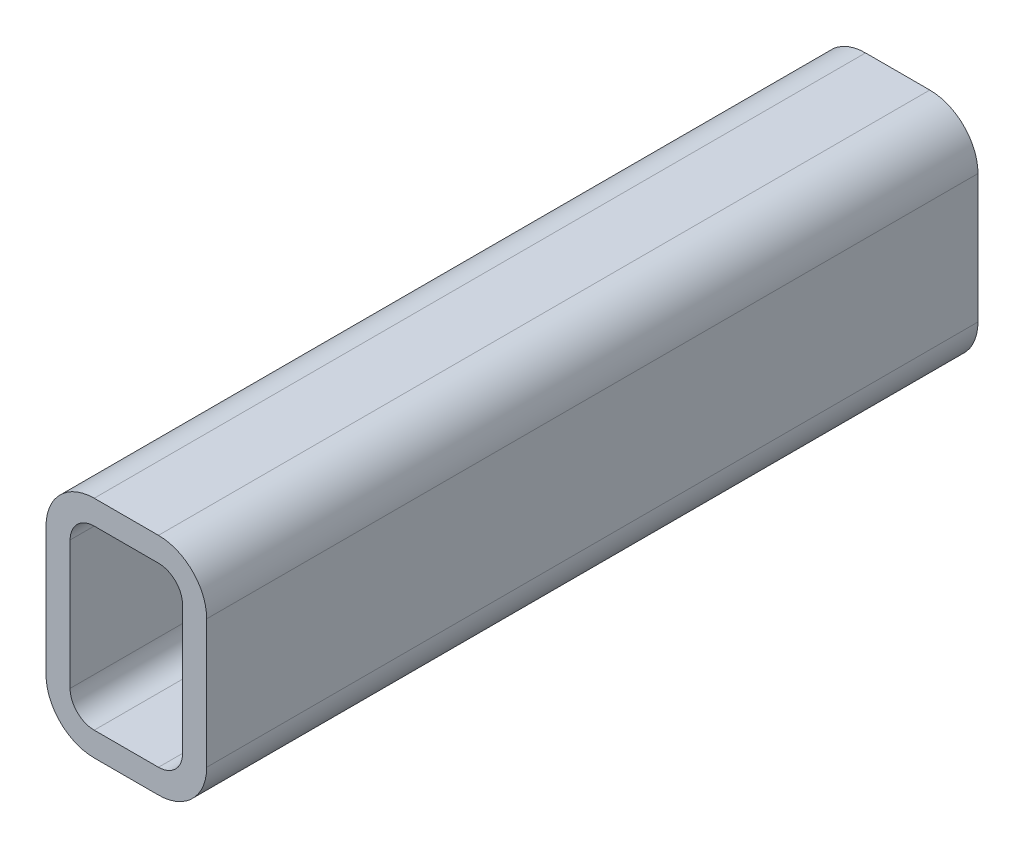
ISO-10303-21;
HEADER;
FILE_DESCRIPTION(('STEP AP214'),'2;1');
FILE_NAME('part.step','',(''),(''),'','','');
FILE_SCHEMA(('AUTOMOTIVE_DESIGN { 1 0 10303 214 1 1 1 1 }'));
ENDSEC;
DATA;
#1=APPLICATION_CONTEXT('core data for automotive mechanical design processes');
#2=APPLICATION_PROTOCOL_DEFINITION('international standard','automotive_design',2000,#1);
#3=PRODUCT_CONTEXT('',#1,'mechanical');
#4=PRODUCT('Part','Part','',(#3));
#5=PRODUCT_RELATED_PRODUCT_CATEGORY('part','',(#4));
#6=PRODUCT_DEFINITION_FORMATION('','',#4);
#7=PRODUCT_DEFINITION_CONTEXT('part definition',#1,'design');
#8=PRODUCT_DEFINITION('design','',#6,#7);
#9=PRODUCT_DEFINITION_SHAPE('','',#8);
#10=(LENGTH_UNIT() NAMED_UNIT(*) SI_UNIT(.MILLI.,.METRE.));
#11=(NAMED_UNIT(*) PLANE_ANGLE_UNIT() SI_UNIT($,.RADIAN.));
#12=(NAMED_UNIT(*) SI_UNIT($,.STERADIAN.) SOLID_ANGLE_UNIT());
#13=UNCERTAINTY_MEASURE_WITH_UNIT(LENGTH_MEASURE(1.E-05),#10,'distance_accuracy_value','');
#14=(GEOMETRIC_REPRESENTATION_CONTEXT(3) GLOBAL_UNCERTAINTY_ASSIGNED_CONTEXT((#13)) GLOBAL_UNIT_ASSIGNED_CONTEXT((#10,
#11,#12)) REPRESENTATION_CONTEXT('',''));
#15=CARTESIAN_POINT('',(0.,0.,0.));
#16=DIRECTION('',(0.,0.,1.));
#17=DIRECTION('',(1.,0.,0.));
#18=AXIS2_PLACEMENT_3D('',#15,#16,#17);
#19=CARTESIAN_POINT('',(21.9460851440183,70.6515103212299,304.8));
#20=DIRECTION('',(0.,0.,1.));
#21=DIRECTION('',(1.,0.,0.));
#22=AXIS2_PLACEMENT_3D('',#19,#20,#21);
#23=PLANE('',#22);
#24=CARTESIAN_POINT('',(21.9460851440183,70.6515103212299,304.8));
#25=DIRECTION('',(0.,0.,1.));
#26=DIRECTION('',(1.,0.,0.));
#27=AXIS2_PLACEMENT_3D('',#24,#25,#26);
#28=CIRCLE('',#27,19.05);
#29=CARTESIAN_POINT('',(21.9460851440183,89.7015103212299,304.8));
#30=VERTEX_POINT('',#29);
#31=CARTESIAN_POINT('',(2.89608514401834,70.6515103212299,304.8));
#32=VERTEX_POINT('',#31);
#33=EDGE_CURVE('E211',#30,#32,#28,.T.);
#34=ORIENTED_EDGE('',*,*,#33,.T.);
#35=DIRECTION('',(0.,-1.,0.));
#36=VECTOR('',#35,1.);
#37=CARTESIAN_POINT('',(2.89608514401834,19.8515103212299,304.8));
#38=LINE('',#37,#36);
#39=CARTESIAN_POINT('',(2.89608514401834,19.8515103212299,304.8));
#40=VERTEX_POINT('',#39);
#41=EDGE_CURVE('E214',#32,#40,#38,.T.);
#42=ORIENTED_EDGE('',*,*,#41,.T.);
#43=CARTESIAN_POINT('',(21.9460851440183,19.8515103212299,304.8));
#44=DIRECTION('',(0.,0.,1.));
#45=DIRECTION('',(1.,0.,0.));
#46=AXIS2_PLACEMENT_3D('',#43,#44,#45);
#47=CIRCLE('',#46,19.05);
#48=CARTESIAN_POINT('',(21.9460851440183,0.801510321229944,304.8));
#49=VERTEX_POINT('',#48);
#50=EDGE_CURVE('E217',#40,#49,#47,.T.);
#51=ORIENTED_EDGE('',*,*,#50,.T.);
#52=DIRECTION('',(1.,0.,0.));
#53=VECTOR('',#52,1.);
#54=CARTESIAN_POINT('',(47.3460851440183,0.801510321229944,304.8));
#55=LINE('',#54,#53);
#56=CARTESIAN_POINT('',(47.3460851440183,0.801510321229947,304.8));
#57=VERTEX_POINT('',#56);
#58=EDGE_CURVE('E219',#49,#57,#55,.T.);
#59=ORIENTED_EDGE('',*,*,#58,.T.);
#60=CARTESIAN_POINT('',(47.3460851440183,19.8515103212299,304.8));
#61=DIRECTION('',(0.,0.,1.));
#62=DIRECTION('',(1.,0.,0.));
#63=AXIS2_PLACEMENT_3D('',#60,#61,#62);
#64=CIRCLE('',#63,19.05);
#65=CARTESIAN_POINT('',(66.3960851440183,19.8515103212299,304.8));
#66=VERTEX_POINT('',#65);
#67=EDGE_CURVE('E221',#57,#66,#64,.T.);
#68=ORIENTED_EDGE('',*,*,#67,.T.);
#69=DIRECTION('',(0.,1.,0.));
#70=VECTOR('',#69,1.);
#71=CARTESIAN_POINT('',(66.3960851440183,70.6515103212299,304.8));
#72=LINE('',#71,#70);
#73=CARTESIAN_POINT('',(66.3960851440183,70.6515103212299,304.8));
#74=VERTEX_POINT('',#73);
#75=EDGE_CURVE('E223',#66,#74,#72,.T.);
#76=ORIENTED_EDGE('',*,*,#75,.T.);
#77=CARTESIAN_POINT('',(47.3460851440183,70.6515103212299,304.8));
#78=DIRECTION('',(0.,0.,1.));
#79=DIRECTION('',(1.,0.,0.));
#80=AXIS2_PLACEMENT_3D('',#77,#78,#79);
#81=CIRCLE('',#80,19.05);
#82=CARTESIAN_POINT('',(47.3460851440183,89.7015103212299,304.8));
#83=VERTEX_POINT('',#82);
#84=EDGE_CURVE('E225',#74,#83,#81,.T.);
#85=ORIENTED_EDGE('',*,*,#84,.T.);
#86=DIRECTION('',(-1.,0.,0.));
#87=VECTOR('',#86,1.);
#88=CARTESIAN_POINT('',(21.9460851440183,89.7015103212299,304.8));
#89=LINE('',#88,#87);
#90=EDGE_CURVE('E227',#83,#30,#89,.T.);
#91=ORIENTED_EDGE('',*,*,#90,.T.);
#92=EDGE_LOOP('',(#34,#42,#51,#59,#68,#76,#85,#91));
#93=FACE_BOUND('',#92,.T.);
#94=DIRECTION('',(0.,-1.,0.));
#95=VECTOR('',#94,1.);
#96=CARTESIAN_POINT('',(12.4210851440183,19.8515103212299,304.8));
#97=LINE('',#96,#95);
#98=CARTESIAN_POINT('',(12.4210851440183,70.6515103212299,304.8));
#99=VERTEX_POINT('',#98);
#100=CARTESIAN_POINT('',(12.4210851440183,19.8515103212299,304.8));
#101=VERTEX_POINT('',#100);
#102=EDGE_CURVE('E154',#99,#101,#97,.T.);
#103=ORIENTED_EDGE('',*,*,#102,.F.);
#104=CARTESIAN_POINT('',(21.9460851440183,70.6515103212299,304.8));
#105=DIRECTION('',(0.,0.,1.));
#106=DIRECTION('',(1.,0.,0.));
#107=AXIS2_PLACEMENT_3D('',#104,#105,#106);
#108=CIRCLE('',#107,9.525);
#109=CARTESIAN_POINT('',(21.9460851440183,80.1765103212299,304.8));
#110=VERTEX_POINT('',#109);
#111=EDGE_CURVE('E146',#110,#99,#108,.T.);
#112=ORIENTED_EDGE('',*,*,#111,.F.);
#113=DIRECTION('',(-1.,0.,0.));
#114=VECTOR('',#113,1.);
#115=CARTESIAN_POINT('',(21.9460851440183,80.1765103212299,304.8));
#116=LINE('',#115,#114);
#117=CARTESIAN_POINT('',(47.3460851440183,80.1765103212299,304.8));
#118=VERTEX_POINT('',#117);
#119=EDGE_CURVE('E179',#118,#110,#116,.T.);
#120=ORIENTED_EDGE('',*,*,#119,.F.);
#121=CARTESIAN_POINT('',(47.3460851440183,70.6515103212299,304.8));
#122=DIRECTION('',(0.,0.,1.));
#123=DIRECTION('',(1.,0.,0.));
#124=AXIS2_PLACEMENT_3D('',#121,#122,#123);
#125=CIRCLE('',#124,9.525);
#126=CARTESIAN_POINT('',(56.8710851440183,70.6515103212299,304.8));
#127=VERTEX_POINT('',#126);
#128=EDGE_CURVE('E177',#127,#118,#125,.T.);
#129=ORIENTED_EDGE('',*,*,#128,.F.);
#130=DIRECTION('',(0.,1.,0.));
#131=VECTOR('',#130,1.);
#132=CARTESIAN_POINT('',(56.8710851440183,70.6515103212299,304.8));
#133=LINE('',#132,#131);
#134=CARTESIAN_POINT('',(56.8710851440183,19.8515103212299,304.8));
#135=VERTEX_POINT('',#134);
#136=EDGE_CURVE('E175',#135,#127,#133,.T.);
#137=ORIENTED_EDGE('',*,*,#136,.F.);
#138=CARTESIAN_POINT('',(47.3460851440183,19.8515103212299,304.8));
#139=DIRECTION('',(0.,0.,1.));
#140=DIRECTION('',(1.,0.,0.));
#141=AXIS2_PLACEMENT_3D('',#138,#139,#140);
#142=CIRCLE('',#141,9.525);
#143=CARTESIAN_POINT('',(47.3460851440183,10.3265103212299,304.8));
#144=VERTEX_POINT('',#143);
#145=EDGE_CURVE('E173',#144,#135,#142,.T.);
#146=ORIENTED_EDGE('',*,*,#145,.F.);
#147=DIRECTION('',(1.,0.,0.));
#148=VECTOR('',#147,1.);
#149=CARTESIAN_POINT('',(47.3460851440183,10.3265103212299,304.8));
#150=LINE('',#149,#148);
#151=CARTESIAN_POINT('',(21.9460851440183,10.3265103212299,304.8));
#152=VERTEX_POINT('',#151);
#153=EDGE_CURVE('E169',#152,#144,#150,.T.);
#154=ORIENTED_EDGE('',*,*,#153,.F.);
#155=CARTESIAN_POINT('',(21.9460851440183,19.8515103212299,304.8));
#156=DIRECTION('',(0.,0.,1.));
#157=DIRECTION('',(1.,0.,0.));
#158=AXIS2_PLACEMENT_3D('',#155,#156,#157);
#159=CIRCLE('',#158,9.525);
#160=EDGE_CURVE('E167',#101,#152,#159,.T.);
#161=ORIENTED_EDGE('',*,*,#160,.F.);
#162=EDGE_LOOP('',(#103,#112,#120,#129,#137,#146,#154,#161));
#163=FACE_BOUND('',#162,.T.);
#164=ADVANCED_FACE('F33',(#93,#163),#23,.T.);
#165=CARTESIAN_POINT('',(21.9460851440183,70.6515103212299,0.));
#166=DIRECTION('',(0.,0.,1.));
#167=DIRECTION('',(1.,0.,0.));
#168=AXIS2_PLACEMENT_3D('',#165,#166,#167);
#169=PLANE('',#168);
#170=CARTESIAN_POINT('',(21.9460851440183,70.6515103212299,0.));
#171=DIRECTION('',(0.,0.,1.));
#172=DIRECTION('',(1.,0.,0.));
#173=AXIS2_PLACEMENT_3D('',#170,#171,#172);
#174=CIRCLE('',#173,19.05);
#175=CARTESIAN_POINT('',(21.9460851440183,89.7015103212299,0.));
#176=VERTEX_POINT('',#175);
#177=CARTESIAN_POINT('',(2.89608514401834,70.6515103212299,0.));
#178=VERTEX_POINT('',#177);
#179=EDGE_CURVE('E162',#176,#178,#174,.T.);
#180=ORIENTED_EDGE('',*,*,#179,.F.);
#181=DIRECTION('',(-1.,0.,0.));
#182=VECTOR('',#181,1.);
#183=CARTESIAN_POINT('',(21.9460851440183,89.7015103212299,0.));
#184=LINE('',#183,#182);
#185=CARTESIAN_POINT('',(47.3460851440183,89.7015103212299,0.));
#186=VERTEX_POINT('',#185);
#187=EDGE_CURVE('E215',#186,#176,#184,.T.);
#188=ORIENTED_EDGE('',*,*,#187,.F.);
#189=CARTESIAN_POINT('',(47.3460851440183,70.6515103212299,0.));
#190=DIRECTION('',(0.,0.,1.));
#191=DIRECTION('',(1.,0.,0.));
#192=AXIS2_PLACEMENT_3D('',#189,#190,#191);
#193=CIRCLE('',#192,19.05);
#194=CARTESIAN_POINT('',(66.3960851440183,70.6515103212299,0.));
#195=VERTEX_POINT('',#194);
#196=EDGE_CURVE('E242',#195,#186,#193,.T.);
#197=ORIENTED_EDGE('',*,*,#196,.F.);
#198=DIRECTION('',(0.,1.,0.));
#199=VECTOR('',#198,1.);
#200=CARTESIAN_POINT('',(66.3960851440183,70.6515103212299,0.));
#201=LINE('',#200,#199);
#202=CARTESIAN_POINT('',(66.3960851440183,19.8515103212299,0.));
#203=VERTEX_POINT('',#202);
#204=EDGE_CURVE('E240',#203,#195,#201,.T.);
#205=ORIENTED_EDGE('',*,*,#204,.F.);
#206=CARTESIAN_POINT('',(47.3460851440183,19.8515103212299,0.));
#207=DIRECTION('',(0.,0.,1.));
#208=DIRECTION('',(1.,0.,0.));
#209=AXIS2_PLACEMENT_3D('',#206,#207,#208);
#210=CIRCLE('',#209,19.05);
#211=CARTESIAN_POINT('',(47.3460851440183,0.801510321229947,0.));
#212=VERTEX_POINT('',#211);
#213=EDGE_CURVE('E238',#212,#203,#210,.T.);
#214=ORIENTED_EDGE('',*,*,#213,.F.);
#215=DIRECTION('',(1.,0.,0.));
#216=VECTOR('',#215,1.);
#217=CARTESIAN_POINT('',(47.3460851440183,0.801510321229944,0.));
#218=LINE('',#217,#216);
#219=CARTESIAN_POINT('',(21.9460851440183,0.801510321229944,0.));
#220=VERTEX_POINT('',#219);
#221=EDGE_CURVE('E236',#220,#212,#218,.T.);
#222=ORIENTED_EDGE('',*,*,#221,.F.);
#223=CARTESIAN_POINT('',(21.9460851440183,19.8515103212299,0.));
#224=DIRECTION('',(0.,0.,1.));
#225=DIRECTION('',(1.,0.,0.));
#226=AXIS2_PLACEMENT_3D('',#223,#224,#225);
#227=CIRCLE('',#226,19.05);
#228=CARTESIAN_POINT('',(2.89608514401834,19.8515103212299,0.));
#229=VERTEX_POINT('',#228);
#230=EDGE_CURVE('E234',#229,#220,#227,.T.);
#231=ORIENTED_EDGE('',*,*,#230,.F.);
#232=DIRECTION('',(0.,-1.,0.));
#233=VECTOR('',#232,1.);
#234=CARTESIAN_POINT('',(2.89608514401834,19.8515103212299,0.));
#235=LINE('',#234,#233);
#236=EDGE_CURVE('E232',#178,#229,#235,.T.);
#237=ORIENTED_EDGE('',*,*,#236,.F.);
#238=EDGE_LOOP('',(#180,#188,#197,#205,#214,#222,#231,#237));
#239=FACE_BOUND('',#238,.T.);
#240=CARTESIAN_POINT('',(21.9460851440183,70.6515103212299,0.));
#241=DIRECTION('',(0.,0.,1.));
#242=DIRECTION('',(1.,0.,0.));
#243=AXIS2_PLACEMENT_3D('',#240,#241,#242);
#244=CIRCLE('',#243,9.525);
#245=CARTESIAN_POINT('',(21.9460851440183,80.1765103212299,0.));
#246=VERTEX_POINT('',#245);
#247=CARTESIAN_POINT('',(12.4210851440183,70.6515103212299,0.));
#248=VERTEX_POINT('',#247);
#249=EDGE_CURVE('E56',#246,#248,#244,.T.);
#250=ORIENTED_EDGE('',*,*,#249,.T.);
#251=DIRECTION('',(0.,-1.,0.));
#252=VECTOR('',#251,1.);
#253=CARTESIAN_POINT('',(12.4210851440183,19.8515103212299,0.));
#254=LINE('',#253,#252);
#255=CARTESIAN_POINT('',(12.4210851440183,19.8515103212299,0.));
#256=VERTEX_POINT('',#255);
#257=EDGE_CURVE('E161',#248,#256,#254,.T.);
#258=ORIENTED_EDGE('',*,*,#257,.T.);
#259=CARTESIAN_POINT('',(21.9460851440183,19.8515103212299,0.));
#260=DIRECTION('',(0.,0.,1.));
#261=DIRECTION('',(1.,0.,0.));
#262=AXIS2_PLACEMENT_3D('',#259,#260,#261);
#263=CIRCLE('',#262,9.525);
#264=CARTESIAN_POINT('',(21.9460851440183,10.3265103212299,0.));
#265=VERTEX_POINT('',#264);
#266=EDGE_CURVE('E183',#256,#265,#263,.T.);
#267=ORIENTED_EDGE('',*,*,#266,.T.);
#268=DIRECTION('',(1.,0.,0.));
#269=VECTOR('',#268,1.);
#270=CARTESIAN_POINT('',(47.3460851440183,10.3265103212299,0.));
#271=LINE('',#270,#269);
#272=CARTESIAN_POINT('',(47.3460851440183,10.3265103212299,0.));
#273=VERTEX_POINT('',#272);
#274=EDGE_CURVE('E186',#265,#273,#271,.T.);
#275=ORIENTED_EDGE('',*,*,#274,.T.);
#276=CARTESIAN_POINT('',(47.3460851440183,19.8515103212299,0.));
#277=DIRECTION('',(0.,0.,1.));
#278=DIRECTION('',(1.,0.,0.));
#279=AXIS2_PLACEMENT_3D('',#276,#277,#278);
#280=CIRCLE('',#279,9.525);
#281=CARTESIAN_POINT('',(56.8710851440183,19.8515103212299,0.));
#282=VERTEX_POINT('',#281);
#283=EDGE_CURVE('E189',#273,#282,#280,.T.);
#284=ORIENTED_EDGE('',*,*,#283,.T.);
#285=DIRECTION('',(0.,1.,0.));
#286=VECTOR('',#285,1.);
#287=CARTESIAN_POINT('',(56.8710851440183,70.6515103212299,0.));
#288=LINE('',#287,#286);
#289=CARTESIAN_POINT('',(56.8710851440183,70.6515103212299,0.));
#290=VERTEX_POINT('',#289);
#291=EDGE_CURVE('E192',#282,#290,#288,.T.);
#292=ORIENTED_EDGE('',*,*,#291,.T.);
#293=CARTESIAN_POINT('',(47.3460851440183,70.6515103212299,0.));
#294=DIRECTION('',(0.,0.,1.));
#295=DIRECTION('',(1.,0.,0.));
#296=AXIS2_PLACEMENT_3D('',#293,#294,#295);
#297=CIRCLE('',#296,9.525);
#298=CARTESIAN_POINT('',(47.3460851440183,80.1765103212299,0.));
#299=VERTEX_POINT('',#298);
#300=EDGE_CURVE('E195',#290,#299,#297,.T.);
#301=ORIENTED_EDGE('',*,*,#300,.T.);
#302=DIRECTION('',(-1.,0.,0.));
#303=VECTOR('',#302,1.);
#304=CARTESIAN_POINT('',(21.9460851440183,80.1765103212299,0.));
#305=LINE('',#304,#303);
#306=EDGE_CURVE('E155',#299,#246,#305,.T.);
#307=ORIENTED_EDGE('',*,*,#306,.T.);
#308=EDGE_LOOP('',(#250,#258,#267,#275,#284,#292,#301,#307));
#309=FACE_BOUND('',#308,.T.);
#310=ADVANCED_FACE('F272',(#239,#309),#169,.F.);
#311=CARTESIAN_POINT('',(21.9460851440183,70.6515103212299,304.8));
#312=DIRECTION('',(0.,0.,-1.));
#313=DIRECTION('',(-1.,0.,0.));
#314=AXIS2_PLACEMENT_3D('',#311,#312,#313);
#315=CYLINDRICAL_SURFACE('',#314,19.05);
#316=ORIENTED_EDGE('',*,*,#179,.T.);
#317=DIRECTION('',(0.,0.,-1.));
#318=VECTOR('',#317,1.);
#319=CARTESIAN_POINT('',(2.89608514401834,70.6515103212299,304.8));
#320=LINE('',#319,#318);
#321=EDGE_CURVE('E11',#32,#178,#320,.T.);
#322=ORIENTED_EDGE('',*,*,#321,.F.);
#323=ORIENTED_EDGE('',*,*,#33,.F.);
#324=DIRECTION('',(0.,0.,-1.));
#325=VECTOR('',#324,1.);
#326=CARTESIAN_POINT('',(21.9460851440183,89.7015103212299,304.8));
#327=LINE('',#326,#325);
#328=EDGE_CURVE('E229',#30,#176,#327,.T.);
#329=ORIENTED_EDGE('',*,*,#328,.T.);
#330=EDGE_LOOP('',(#316,#322,#323,#329));
#331=FACE_BOUND('',#330,.T.);
#332=ADVANCED_FACE('F35',(#331),#315,.T.);
#333=CARTESIAN_POINT('',(2.89608514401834,19.8515103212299,304.8));
#334=DIRECTION('',(1.,0.,0.));
#335=DIRECTION('',(0.,0.,-1.));
#336=AXIS2_PLACEMENT_3D('',#333,#334,#335);
#337=PLANE('',#336);
#338=ORIENTED_EDGE('',*,*,#236,.T.);
#339=DIRECTION('',(0.,0.,-1.));
#340=VECTOR('',#339,1.);
#341=CARTESIAN_POINT('',(2.89608514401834,19.8515103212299,304.8));
#342=LINE('',#341,#340);
#343=EDGE_CURVE('E41',#40,#229,#342,.T.);
#344=ORIENTED_EDGE('',*,*,#343,.F.);
#345=ORIENTED_EDGE('',*,*,#41,.F.);
#346=ORIENTED_EDGE('',*,*,#321,.T.);
#347=EDGE_LOOP('',(#338,#344,#345,#346));
#348=FACE_BOUND('',#347,.T.);
#349=ADVANCED_FACE('F289',(#348),#337,.F.);
#350=CARTESIAN_POINT('',(21.9460851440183,19.8515103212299,304.8));
#351=DIRECTION('',(0.,0.,-1.));
#352=DIRECTION('',(-1.,0.,0.));
#353=AXIS2_PLACEMENT_3D('',#350,#351,#352);
#354=CYLINDRICAL_SURFACE('',#353,19.05);
#355=ORIENTED_EDGE('',*,*,#230,.T.);
#356=DIRECTION('',(0.,0.,-1.));
#357=VECTOR('',#356,1.);
#358=CARTESIAN_POINT('',(21.9460851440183,0.801510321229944,304.8));
#359=LINE('',#358,#357);
#360=EDGE_CURVE('E259',#49,#220,#359,.T.);
#361=ORIENTED_EDGE('',*,*,#360,.F.);
#362=ORIENTED_EDGE('',*,*,#50,.F.);
#363=ORIENTED_EDGE('',*,*,#343,.T.);
#364=EDGE_LOOP('',(#355,#361,#362,#363));
#365=FACE_BOUND('',#364,.T.);
#366=ADVANCED_FACE('F266',(#365),#354,.T.);
#367=CARTESIAN_POINT('',(47.3460851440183,0.801510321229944,304.8));
#368=DIRECTION('',(0.,1.,0.));
#369=DIRECTION('',(0.,0.,1.));
#370=AXIS2_PLACEMENT_3D('',#367,#368,#369);
#371=PLANE('',#370);
#372=ORIENTED_EDGE('',*,*,#221,.T.);
#373=DIRECTION('',(0.,0.,-1.));
#374=VECTOR('',#373,1.);
#375=CARTESIAN_POINT('',(47.3460851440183,0.801510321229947,304.8));
#376=LINE('',#375,#374);
#377=EDGE_CURVE('E256',#57,#212,#376,.T.);
#378=ORIENTED_EDGE('',*,*,#377,.F.);
#379=ORIENTED_EDGE('',*,*,#58,.F.);
#380=ORIENTED_EDGE('',*,*,#360,.T.);
#381=EDGE_LOOP('',(#372,#378,#379,#380));
#382=FACE_BOUND('',#381,.T.);
#383=ADVANCED_FACE('F278',(#382),#371,.F.);
#384=CARTESIAN_POINT('',(47.3460851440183,19.8515103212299,304.8));
#385=DIRECTION('',(0.,0.,-1.));
#386=DIRECTION('',(-1.,0.,0.));
#387=AXIS2_PLACEMENT_3D('',#384,#385,#386);
#388=CYLINDRICAL_SURFACE('',#387,19.05);
#389=ORIENTED_EDGE('',*,*,#213,.T.);
#390=DIRECTION('',(0.,0.,-1.));
#391=VECTOR('',#390,1.);
#392=CARTESIAN_POINT('',(66.3960851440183,19.8515103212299,304.8));
#393=LINE('',#392,#391);
#394=EDGE_CURVE('E253',#66,#203,#393,.T.);
#395=ORIENTED_EDGE('',*,*,#394,.F.);
#396=ORIENTED_EDGE('',*,*,#67,.F.);
#397=ORIENTED_EDGE('',*,*,#377,.T.);
#398=EDGE_LOOP('',(#389,#395,#396,#397));
#399=FACE_BOUND('',#398,.T.);
#400=ADVANCED_FACE('F282',(#399),#388,.T.);
#401=CARTESIAN_POINT('',(66.3960851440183,70.6515103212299,304.8));
#402=DIRECTION('',(-1.,0.,0.));
#403=DIRECTION('',(0.,0.,1.));
#404=AXIS2_PLACEMENT_3D('',#401,#402,#403);
#405=PLANE('',#404);
#406=ORIENTED_EDGE('',*,*,#204,.T.);
#407=DIRECTION('',(0.,0.,-1.));
#408=VECTOR('',#407,1.);
#409=CARTESIAN_POINT('',(66.3960851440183,70.6515103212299,304.8));
#410=LINE('',#409,#408);
#411=EDGE_CURVE('E250',#74,#195,#410,.T.);
#412=ORIENTED_EDGE('',*,*,#411,.F.);
#413=ORIENTED_EDGE('',*,*,#75,.F.);
#414=ORIENTED_EDGE('',*,*,#394,.T.);
#415=EDGE_LOOP('',(#406,#412,#413,#414));
#416=FACE_BOUND('',#415,.T.);
#417=ADVANCED_FACE('F302',(#416),#405,.F.);
#418=CARTESIAN_POINT('',(47.3460851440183,70.6515103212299,304.8));
#419=DIRECTION('',(0.,0.,-1.));
#420=DIRECTION('',(-1.,0.,0.));
#421=AXIS2_PLACEMENT_3D('',#418,#419,#420);
#422=CYLINDRICAL_SURFACE('',#421,19.05);
#423=ORIENTED_EDGE('',*,*,#196,.T.);
#424=DIRECTION('',(0.,0.,-1.));
#425=VECTOR('',#424,1.);
#426=CARTESIAN_POINT('',(47.3460851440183,89.7015103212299,304.8));
#427=LINE('',#426,#425);
#428=EDGE_CURVE('E247',#83,#186,#427,.T.);
#429=ORIENTED_EDGE('',*,*,#428,.F.);
#430=ORIENTED_EDGE('',*,*,#84,.F.);
#431=ORIENTED_EDGE('',*,*,#411,.T.);
#432=EDGE_LOOP('',(#423,#429,#430,#431));
#433=FACE_BOUND('',#432,.T.);
#434=ADVANCED_FACE('F300',(#433),#422,.T.);
#435=CARTESIAN_POINT('',(21.9460851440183,89.7015103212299,304.8));
#436=DIRECTION('',(0.,-1.,0.));
#437=DIRECTION('',(0.,0.,-1.));
#438=AXIS2_PLACEMENT_3D('',#435,#436,#437);
#439=PLANE('',#438);
#440=ORIENTED_EDGE('',*,*,#187,.T.);
#441=ORIENTED_EDGE('',*,*,#328,.F.);
#442=ORIENTED_EDGE('',*,*,#90,.F.);
#443=ORIENTED_EDGE('',*,*,#428,.T.);
#444=EDGE_LOOP('',(#440,#441,#442,#443));
#445=FACE_BOUND('',#444,.T.);
#446=ADVANCED_FACE('F295',(#445),#439,.F.);
#447=CARTESIAN_POINT('',(21.9460851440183,70.6515103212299,304.8));
#448=DIRECTION('',(0.,0.,-1.));
#449=DIRECTION('',(-1.,0.,0.));
#450=AXIS2_PLACEMENT_3D('',#447,#448,#449);
#451=CYLINDRICAL_SURFACE('',#450,9.525);
#452=ORIENTED_EDGE('',*,*,#249,.F.);
#453=DIRECTION('',(0.,0.,-1.));
#454=VECTOR('',#453,1.);
#455=CARTESIAN_POINT('',(21.9460851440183,80.1765103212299,304.8));
#456=LINE('',#455,#454);
#457=EDGE_CURVE('E150',#110,#246,#456,.T.);
#458=ORIENTED_EDGE('',*,*,#457,.F.);
#459=ORIENTED_EDGE('',*,*,#111,.T.);
#460=DIRECTION('',(0.,0.,-1.));
#461=VECTOR('',#460,1.);
#462=CARTESIAN_POINT('',(12.4210851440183,70.6515103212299,304.8));
#463=LINE('',#462,#461);
#464=EDGE_CURVE('E149',#99,#248,#463,.T.);
#465=ORIENTED_EDGE('',*,*,#464,.T.);
#466=EDGE_LOOP('',(#452,#458,#459,#465));
#467=FACE_BOUND('',#466,.T.);
#468=ADVANCED_FACE('F148',(#467),#451,.F.);
#469=CARTESIAN_POINT('',(12.4210851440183,19.8515103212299,304.8));
#470=DIRECTION('',(1.,0.,0.));
#471=DIRECTION('',(0.,0.,-1.));
#472=AXIS2_PLACEMENT_3D('',#469,#470,#471);
#473=PLANE('',#472);
#474=ORIENTED_EDGE('',*,*,#257,.F.);
#475=ORIENTED_EDGE('',*,*,#464,.F.);
#476=ORIENTED_EDGE('',*,*,#102,.T.);
#477=DIRECTION('',(0.,0.,-1.));
#478=VECTOR('',#477,1.);
#479=CARTESIAN_POINT('',(12.4210851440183,19.8515103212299,304.8));
#480=LINE('',#479,#478);
#481=EDGE_CURVE('E163',#101,#256,#480,.T.);
#482=ORIENTED_EDGE('',*,*,#481,.T.);
#483=EDGE_LOOP('',(#474,#475,#476,#482));
#484=FACE_BOUND('',#483,.T.);
#485=ADVANCED_FACE('F158',(#484),#473,.T.);
#486=CARTESIAN_POINT('',(21.9460851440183,19.8515103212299,304.8));
#487=DIRECTION('',(0.,0.,-1.));
#488=DIRECTION('',(-1.,0.,0.));
#489=AXIS2_PLACEMENT_3D('',#486,#487,#488);
#490=CYLINDRICAL_SURFACE('',#489,9.525);
#491=ORIENTED_EDGE('',*,*,#266,.F.);
#492=ORIENTED_EDGE('',*,*,#481,.F.);
#493=ORIENTED_EDGE('',*,*,#160,.T.);
#494=DIRECTION('',(0.,0.,-1.));
#495=VECTOR('',#494,1.);
#496=CARTESIAN_POINT('',(21.9460851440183,10.3265103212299,304.8));
#497=LINE('',#496,#495);
#498=EDGE_CURVE('E208',#152,#265,#497,.T.);
#499=ORIENTED_EDGE('',*,*,#498,.T.);
#500=EDGE_LOOP('',(#491,#492,#493,#499));
#501=FACE_BOUND('',#500,.T.);
#502=ADVANCED_FACE('F327',(#501),#490,.F.);
#503=CARTESIAN_POINT('',(47.3460851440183,10.3265103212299,304.8));
#504=DIRECTION('',(0.,1.,0.));
#505=DIRECTION('',(0.,0.,1.));
#506=AXIS2_PLACEMENT_3D('',#503,#504,#505);
#507=PLANE('',#506);
#508=ORIENTED_EDGE('',*,*,#274,.F.);
#509=ORIENTED_EDGE('',*,*,#498,.F.);
#510=ORIENTED_EDGE('',*,*,#153,.T.);
#511=DIRECTION('',(0.,0.,-1.));
#512=VECTOR('',#511,1.);
#513=CARTESIAN_POINT('',(47.3460851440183,10.3265103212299,304.8));
#514=LINE('',#513,#512);
#515=EDGE_CURVE('E206',#144,#273,#514,.T.);
#516=ORIENTED_EDGE('',*,*,#515,.T.);
#517=EDGE_LOOP('',(#508,#509,#510,#516));
#518=FACE_BOUND('',#517,.T.);
#519=ADVANCED_FACE('F331',(#518),#507,.T.);
#520=CARTESIAN_POINT('',(47.3460851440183,19.8515103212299,304.8));
#521=DIRECTION('',(0.,0.,-1.));
#522=DIRECTION('',(-1.,0.,0.));
#523=AXIS2_PLACEMENT_3D('',#520,#521,#522);
#524=CYLINDRICAL_SURFACE('',#523,9.525);
#525=ORIENTED_EDGE('',*,*,#283,.F.);
#526=ORIENTED_EDGE('',*,*,#515,.F.);
#527=ORIENTED_EDGE('',*,*,#145,.T.);
#528=DIRECTION('',(0.,0.,-1.));
#529=VECTOR('',#528,1.);
#530=CARTESIAN_POINT('',(56.8710851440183,19.8515103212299,304.8));
#531=LINE('',#530,#529);
#532=EDGE_CURVE('E204',#135,#282,#531,.T.);
#533=ORIENTED_EDGE('',*,*,#532,.T.);
#534=EDGE_LOOP('',(#525,#526,#527,#533));
#535=FACE_BOUND('',#534,.T.);
#536=ADVANCED_FACE('F337',(#535),#524,.F.);
#537=CARTESIAN_POINT('',(56.8710851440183,70.6515103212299,304.8));
#538=DIRECTION('',(-1.,0.,0.));
#539=DIRECTION('',(0.,0.,1.));
#540=AXIS2_PLACEMENT_3D('',#537,#538,#539);
#541=PLANE('',#540);
#542=ORIENTED_EDGE('',*,*,#291,.F.);
#543=ORIENTED_EDGE('',*,*,#532,.F.);
#544=ORIENTED_EDGE('',*,*,#136,.T.);
#545=DIRECTION('',(0.,0.,-1.));
#546=VECTOR('',#545,1.);
#547=CARTESIAN_POINT('',(56.8710851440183,70.6515103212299,304.8));
#548=LINE('',#547,#546);
#549=EDGE_CURVE('E202',#127,#290,#548,.T.);
#550=ORIENTED_EDGE('',*,*,#549,.T.);
#551=EDGE_LOOP('',(#542,#543,#544,#550));
#552=FACE_BOUND('',#551,.T.);
#553=ADVANCED_FACE('F341',(#552),#541,.T.);
#554=CARTESIAN_POINT('',(47.3460851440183,70.6515103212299,304.8));
#555=DIRECTION('',(0.,0.,-1.));
#556=DIRECTION('',(-1.,0.,0.));
#557=AXIS2_PLACEMENT_3D('',#554,#555,#556);
#558=CYLINDRICAL_SURFACE('',#557,9.525);
#559=ORIENTED_EDGE('',*,*,#300,.F.);
#560=ORIENTED_EDGE('',*,*,#549,.F.);
#561=ORIENTED_EDGE('',*,*,#128,.T.);
#562=DIRECTION('',(0.,0.,-1.));
#563=VECTOR('',#562,1.);
#564=CARTESIAN_POINT('',(47.3460851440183,80.1765103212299,304.8));
#565=LINE('',#564,#563);
#566=EDGE_CURVE('E48',#118,#299,#565,.T.);
#567=ORIENTED_EDGE('',*,*,#566,.T.);
#568=EDGE_LOOP('',(#559,#560,#561,#567));
#569=FACE_BOUND('',#568,.T.);
#570=ADVANCED_FACE('F345',(#569),#558,.F.);
#571=CARTESIAN_POINT('',(21.9460851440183,80.1765103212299,304.8));
#572=DIRECTION('',(0.,-1.,0.));
#573=DIRECTION('',(0.,0.,-1.));
#574=AXIS2_PLACEMENT_3D('',#571,#572,#573);
#575=PLANE('',#574);
#576=ORIENTED_EDGE('',*,*,#306,.F.);
#577=ORIENTED_EDGE('',*,*,#566,.F.);
#578=ORIENTED_EDGE('',*,*,#119,.T.);
#579=ORIENTED_EDGE('',*,*,#457,.T.);
#580=EDGE_LOOP('',(#576,#577,#578,#579));
#581=FACE_BOUND('',#580,.T.);
#582=ADVANCED_FACE('F349',(#581),#575,.T.);
#583=CLOSED_SHELL('',(#164,#310,#332,#349,#366,#383,#400,#417,#434,#446,#468,#485,#502,#519,
#536,#553,#570,#582));
#584=MANIFOLD_SOLID_BREP('B2',#583);
#585=ADVANCED_BREP_SHAPE_REPRESENTATION('',(#18,#584),#14);
#586=SHAPE_DEFINITION_REPRESENTATION(#9,#585);
ENDSEC;
END-ISO-10303-21;
